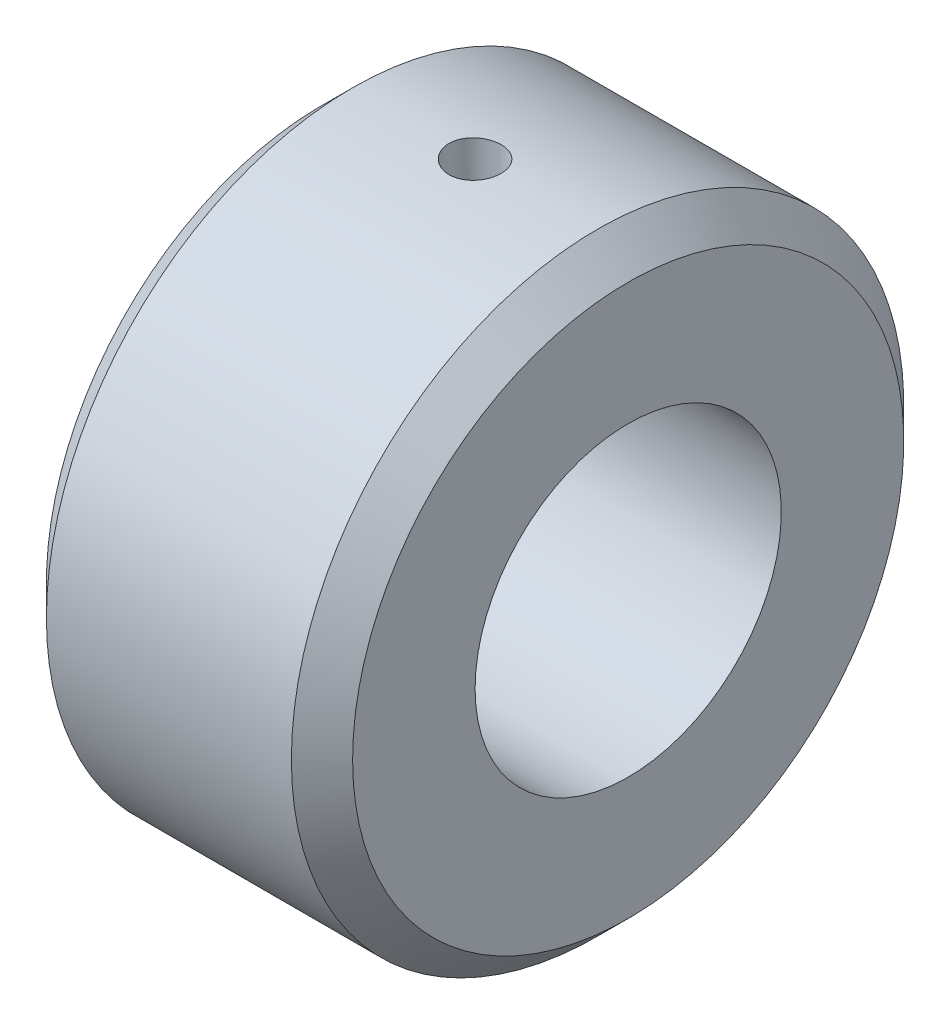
ISO-10303-21;
HEADER;
FILE_DESCRIPTION(('STEP AP214'),'2;1');
FILE_NAME('part.step','',(''),(''),'','','');
FILE_SCHEMA(('AUTOMOTIVE_DESIGN { 1 0 10303 214 1 1 1 1 }'));
ENDSEC;
DATA;
#1=APPLICATION_CONTEXT('core data for automotive mechanical design processes');
#2=APPLICATION_PROTOCOL_DEFINITION('international standard','automotive_design',2000,#1);
#3=PRODUCT_CONTEXT('',#1,'mechanical');
#4=PRODUCT('Part','Part','',(#3));
#5=PRODUCT_RELATED_PRODUCT_CATEGORY('part','',(#4));
#6=PRODUCT_DEFINITION_FORMATION('','',#4);
#7=PRODUCT_DEFINITION_CONTEXT('part definition',#1,'design');
#8=PRODUCT_DEFINITION('design','',#6,#7);
#9=PRODUCT_DEFINITION_SHAPE('','',#8);
#10=(LENGTH_UNIT() NAMED_UNIT(*) SI_UNIT(.MILLI.,.METRE.));
#11=(NAMED_UNIT(*) PLANE_ANGLE_UNIT() SI_UNIT($,.RADIAN.));
#12=(NAMED_UNIT(*) SI_UNIT($,.STERADIAN.) SOLID_ANGLE_UNIT());
#13=UNCERTAINTY_MEASURE_WITH_UNIT(LENGTH_MEASURE(1.E-05),#10,'distance_accuracy_value','');
#14=(GEOMETRIC_REPRESENTATION_CONTEXT(3) GLOBAL_UNCERTAINTY_ASSIGNED_CONTEXT((#13)) GLOBAL_UNIT_ASSIGNED_CONTEXT((#10,
#11,#12)) REPRESENTATION_CONTEXT('',''));
#15=CARTESIAN_POINT('',(0.,0.,0.));
#16=DIRECTION('',(0.,0.,1.));
#17=DIRECTION('',(1.,0.,0.));
#18=AXIS2_PLACEMENT_3D('',#15,#16,#17);
#19=CARTESIAN_POINT('',(-24.2284170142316,50.,0.));
#20=DIRECTION('',(1.,0.,0.));
#21=DIRECTION('',(0.,0.,-1.));
#22=AXIS2_PLACEMENT_3D('',#19,#20,#21);
#23=PLANE('',#22);
#24=CARTESIAN_POINT('',(-24.2284170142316,0.,0.));
#25=DIRECTION('',(1.,0.,0.));
#26=DIRECTION('',(0.,0.,-1.));
#27=AXIS2_PLACEMENT_3D('',#24,#25,#26);
#28=CIRCLE('',#27,45.);
#29=CARTESIAN_POINT('',(-24.2284170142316,0.,-45.));
#30=VERTEX_POINT('',#29);
#31=EDGE_CURVE('E42',#30,#30,#28,.F.);
#32=ORIENTED_EDGE('',*,*,#31,.T.);
#33=EDGE_LOOP('',(#32));
#34=FACE_BOUND('',#33,.T.);
#35=CARTESIAN_POINT('',(-24.2284170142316,0.,0.));
#36=DIRECTION('',(-1.,0.,0.));
#37=DIRECTION('',(0.,0.,1.));
#38=AXIS2_PLACEMENT_3D('',#35,#36,#37);
#39=CIRCLE('',#38,25.);
#40=CARTESIAN_POINT('',(-24.2284170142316,0.,25.));
#41=VERTEX_POINT('',#40);
#42=EDGE_CURVE('E58',#41,#41,#39,.T.);
#43=ORIENTED_EDGE('',*,*,#42,.F.);
#44=EDGE_LOOP('',(#43));
#45=FACE_BOUND('',#44,.T.);
#46=ADVANCED_FACE('F31',(#34,#45),#23,.F.);
#47=CARTESIAN_POINT('',(-35.4974481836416,0.,0.));
#48=DIRECTION('',(-1.,0.,0.));
#49=DIRECTION('',(0.,0.,1.));
#50=AXIS2_PLACEMENT_3D('',#47,#48,#49);
#51=CYLINDRICAL_SURFACE('',#50,25.);
#52=CARTESIAN_POINT('',(0.771582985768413,24.6361015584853,-4.24999999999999));
#53=CARTESIAN_POINT('',(0.53471664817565,24.6361058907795,-4.2499905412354));
#54=CARTESIAN_POINT('',(0.297722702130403,24.6395546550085,-4.23013092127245));
#55=CARTESIAN_POINT('',(-0.169610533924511,24.6529638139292,-4.15125457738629));
#56=CARTESIAN_POINT('',(-0.399943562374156,24.6629301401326,-4.09220218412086));
#57=CARTESIAN_POINT('',(-0.847124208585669,24.6882137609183,-3.93678254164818));
#58=CARTESIAN_POINT('',(-1.06398311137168,24.7035265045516,-3.84044702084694));
#59=CARTESIAN_POINT('',(-1.47843773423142,24.7377722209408,-3.61327556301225));
#60=CARTESIAN_POINT('',(-1.67603551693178,24.7567048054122,-3.48244332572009));
#61=CARTESIAN_POINT('',(-2.04840652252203,24.7962738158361,-3.18856188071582));
#62=CARTESIAN_POINT('',(-2.22295365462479,24.8169242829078,-3.02522804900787));
#63=CARTESIAN_POINT('',(-2.54230390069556,24.8574776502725,-2.67159497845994));
#64=CARTESIAN_POINT('',(-2.68710522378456,24.8773805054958,-2.48129411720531));
#65=CARTESIAN_POINT('',(-2.94370482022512,24.9143450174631,-2.07766083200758));
#66=CARTESIAN_POINT('',(-3.05529224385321,24.9313882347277,-1.86419253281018));
#67=CARTESIAN_POINT('',(-3.24094074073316,24.9605567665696,-1.42120303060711));
#68=CARTESIAN_POINT('',(-3.31500435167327,24.9726824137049,-1.19168291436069));
#69=CARTESIAN_POINT('',(-3.42281012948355,24.9905504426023,-0.725442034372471));
#70=CARTESIAN_POINT('',(-3.45693238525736,24.9963529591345,-0.488811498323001));
#71=CARTESIAN_POINT('',(-3.48506912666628,25.0011276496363,-0.013117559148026));
#72=CARTESIAN_POINT('',(-3.47908644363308,25.000100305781,0.225945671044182));
#73=CARTESIAN_POINT('',(-3.42747880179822,24.9913785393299,0.697118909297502));
#74=CARTESIAN_POINT('',(-3.38226292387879,24.9837529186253,0.929275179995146));
#75=CARTESIAN_POINT('',(-3.25411699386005,24.962768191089,1.38265670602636));
#76=CARTESIAN_POINT('',(-3.17118575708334,24.9494089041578,1.60388161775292));
#77=CARTESIAN_POINT('',(-2.96955924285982,24.9183410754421,2.03033266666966));
#78=CARTESIAN_POINT('',(-2.85069617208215,24.9006122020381,2.23547792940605));
#79=CARTESIAN_POINT('',(-2.58070311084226,24.8627735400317,2.62306501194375));
#80=CARTESIAN_POINT('',(-2.42957040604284,24.842663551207,2.80550491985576));
#81=CARTESIAN_POINT('',(-2.09706145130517,24.8019982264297,3.14492053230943));
#82=CARTESIAN_POINT('',(-1.91532760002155,24.7814404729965,3.30154582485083));
#83=CARTESIAN_POINT('',(-1.52797790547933,24.74244162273,3.58213794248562));
#84=CARTESIAN_POINT('',(-1.32236182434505,24.7240005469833,3.70610444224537));
#85=CARTESIAN_POINT('',(-0.89266912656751,24.6913214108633,3.91793359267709));
#86=CARTESIAN_POINT('',(-0.668570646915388,24.6770884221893,4.00575272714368));
#87=CARTESIAN_POINT('',(-0.208506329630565,24.6545198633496,4.14240191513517));
#88=CARTESIAN_POINT('',(0.0274584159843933,24.6461837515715,4.19123554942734));
#89=CARTESIAN_POINT('',(0.501418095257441,24.6364579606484,4.24803134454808));
#90=CARTESIAN_POINT('',(0.739351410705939,24.6349832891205,4.25649361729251));
#91=CARTESIAN_POINT('',(1.21323412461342,24.6389208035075,4.23364039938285));
#92=CARTESIAN_POINT('',(1.44918360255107,24.6443327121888,4.20232651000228));
#93=CARTESIAN_POINT('',(1.91080383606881,24.6613549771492,4.10123670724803));
#94=CARTESIAN_POINT('',(2.13653224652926,24.6729241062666,4.03171651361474));
#95=CARTESIAN_POINT('',(2.57313515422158,24.7009225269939,3.85645619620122));
#96=CARTESIAN_POINT('',(2.78400872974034,24.7173521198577,3.75071382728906));
#97=CARTESIAN_POINT('',(3.18713839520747,24.7534171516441,3.50483494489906));
#98=CARTESIAN_POINT('',(3.37919677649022,24.7730817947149,3.36437864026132));
#99=CARTESIAN_POINT('',(3.7371977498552,24.8133163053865,3.05349666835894));
#100=CARTESIAN_POINT('',(3.90313842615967,24.8338862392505,2.88306880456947));
#101=CARTESIAN_POINT('',(4.20602617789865,24.8738831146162,2.51486305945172));
#102=CARTESIAN_POINT('',(4.34263929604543,24.8932952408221,2.31680860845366));
#103=CARTESIAN_POINT('',(4.58065210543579,24.9285498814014,1.90026960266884));
#104=CARTESIAN_POINT('',(4.68205297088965,24.9443925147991,1.68178572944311));
#105=CARTESIAN_POINT('',(4.846246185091,24.9706588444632,1.23157131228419));
#106=CARTESIAN_POINT('',(4.90921164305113,24.9811068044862,0.999905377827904));
#107=CARTESIAN_POINT('',(4.99530340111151,24.9955093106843,0.529094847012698));
#108=CARTESIAN_POINT('',(5.01843311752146,24.9994644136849,0.289950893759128));
#109=CARTESIAN_POINT('',(5.02409536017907,25.0004272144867,-0.185807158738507));
#110=CARTESIAN_POINT('',(5.00713542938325,24.9975217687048,-0.422415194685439));
#111=CARTESIAN_POINT('',(4.93419970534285,24.9852677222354,-0.889360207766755));
#112=CARTESIAN_POINT('',(4.87822415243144,24.9759191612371,-1.11969722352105));
#113=CARTESIAN_POINT('',(4.72904388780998,24.9518260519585,-1.56735653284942));
#114=CARTESIAN_POINT('',(4.63588400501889,24.9370880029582,-1.78469413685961));
#115=CARTESIAN_POINT('',(4.41503667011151,24.9038227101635,-2.20073172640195));
#116=CARTESIAN_POINT('',(4.28734747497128,24.8852952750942,-2.39943077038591));
#117=CARTESIAN_POINT('',(3.99927474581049,24.8462259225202,-2.77510357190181));
#118=CARTESIAN_POINT('',(3.83852027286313,24.8256626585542,-2.95179069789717));
#119=CARTESIAN_POINT('',(3.48965757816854,24.7849850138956,-3.27586034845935));
#120=CARTESIAN_POINT('',(3.30154295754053,24.7648707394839,-3.42323599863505));
#121=CARTESIAN_POINT('',(2.90164588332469,24.7272075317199,-3.68550440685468));
#122=CARTESIAN_POINT('',(2.68969871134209,24.7096786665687,-3.8001489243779));
#123=CARTESIAN_POINT('',(2.24933989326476,24.6794086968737,-3.99202979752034));
#124=CARTESIAN_POINT('',(2.02094481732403,24.6666628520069,-4.06930321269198));
#125=CARTESIAN_POINT('',(1.62167337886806,24.650203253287,-4.16762904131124));
#126=CARTESIAN_POINT('',(1.45320323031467,24.6449448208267,-4.19846808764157));
#127=CARTESIAN_POINT('',(1.11370521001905,24.6378924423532,-4.2396567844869));
#128=CARTESIAN_POINT('',(0.942677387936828,24.6360984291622,-4.25000683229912));
#129=CARTESIAN_POINT('',(0.771582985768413,24.6361015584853,-4.24999999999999));
#130=B_SPLINE_CURVE_WITH_KNOTS('',3,(#52,#53,#54,#55,#56,#57,#58,#59,#60,#61,#62,#63,#64,#65,
#66,#67,#68,#69,#70,#71,#72,#73,#74,#75,#76,#77,#78,#79,#80,#81,#82,#83,#84,#85,#86,#87,#88,#89,
#90,#91,#92,#93,#94,#95,#96,#97,#98,#99,#100,#101,#102,#103,#104,#105,#106,#107,#108,#109,#110,
#111,#112,#113,#114,#115,#116,#117,#118,#119,#120,#121,#122,#123,#124,#125,#126,#127,#128,#129),
.UNSPECIFIED.,.T.,.F.,(4,2,2,2,2,2,2,2,2,2,2,2,2,2,2,2,2,2,2,2,2,2,2,2,2,2,2,2,2,2,2,2,2,2,2,2,
2,2,4),(0.,0.709973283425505,1.42059360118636,2.13061049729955,2.84055127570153,
3.55700687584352,4.27350559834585,4.99446029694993,5.71536623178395,6.42935464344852,
7.14329264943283,7.84987474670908,8.55647903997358,9.26643536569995,9.97645143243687,
10.6954278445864,11.4144114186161,12.1342580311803,12.8540385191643,13.5648789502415,
14.2756907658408,14.9818019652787,15.687956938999,16.4008768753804,17.1138490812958,
17.8345535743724,18.5552340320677,19.2726441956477,19.9899928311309,20.6983084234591,
21.4066196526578,22.1140795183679,22.8215751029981,23.5374888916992,24.2535703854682,
24.9749466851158,25.6956061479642,26.2084473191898,26.7212785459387),.UNSPECIFIED.);
#131=CARTESIAN_POINT('',(0.771582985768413,24.6361015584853,-4.24999999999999));
#132=VERTEX_POINT('',#131);
#133=EDGE_CURVE('E64',#132,#132,#130,.T.);
#134=ORIENTED_EDGE('',*,*,#133,.T.);
#135=EDGE_LOOP('',(#134));
#136=FACE_BOUND('',#135,.T.);
#137=CARTESIAN_POINT('',(25.7715829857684,0.,0.));
#138=DIRECTION('',(-1.,0.,0.));
#139=DIRECTION('',(0.,0.,1.));
#140=AXIS2_PLACEMENT_3D('',#137,#138,#139);
#141=CIRCLE('',#140,25.);
#142=CARTESIAN_POINT('',(25.7715829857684,0.,25.));
#143=VERTEX_POINT('',#142);
#144=EDGE_CURVE('E61',#143,#143,#141,.T.);
#145=ORIENTED_EDGE('',*,*,#144,.F.);
#146=EDGE_LOOP('',(#145));
#147=FACE_BOUND('',#146,.T.);
#148=ORIENTED_EDGE('',*,*,#42,.T.);
#149=EDGE_LOOP('',(#148));
#150=FACE_BOUND('',#149,.T.);
#151=ADVANCED_FACE('F69',(#136,#147,#150),#51,.F.);
#152=CARTESIAN_POINT('',(25.7715829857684,50.,0.));
#153=DIRECTION('',(-1.,0.,0.));
#154=DIRECTION('',(0.,0.,1.));
#155=AXIS2_PLACEMENT_3D('',#152,#153,#154);
#156=PLANE('',#155);
#157=CARTESIAN_POINT('',(25.7715829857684,0.,0.));
#158=DIRECTION('',(-1.,0.,0.));
#159=DIRECTION('',(0.,0.,1.));
#160=AXIS2_PLACEMENT_3D('',#157,#158,#159);
#161=CIRCLE('',#160,45.);
#162=CARTESIAN_POINT('',(25.7715829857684,0.,45.));
#163=VERTEX_POINT('',#162);
#164=EDGE_CURVE('E46',#163,#163,#161,.F.);
#165=ORIENTED_EDGE('',*,*,#164,.T.);
#166=EDGE_LOOP('',(#165));
#167=FACE_BOUND('',#166,.T.);
#168=ORIENTED_EDGE('',*,*,#144,.T.);
#169=EDGE_LOOP('',(#168));
#170=FACE_BOUND('',#169,.T.);
#171=ADVANCED_FACE('F82',(#167,#170),#156,.F.);
#172=CARTESIAN_POINT('',(-35.4974481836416,0.,0.));
#173=DIRECTION('',(-1.,0.,0.));
#174=DIRECTION('',(0.,0.,1.));
#175=AXIS2_PLACEMENT_3D('',#172,#173,#174);
#176=CYLINDRICAL_SURFACE('',#175,50.);
#177=CARTESIAN_POINT('',(-3.47841701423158,50.,0.));
#178=CARTESIAN_POINT('',(-3.47840661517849,49.9999976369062,-0.238263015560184));
#179=CARTESIAN_POINT('',(-3.45831340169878,49.9982787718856,-0.476687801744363));
#180=CARTESIAN_POINT('',(-3.37845414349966,49.9915871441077,-0.946939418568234));
#181=CARTESIAN_POINT('',(-3.31864326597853,49.9866107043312,-1.17875848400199));
#182=CARTESIAN_POINT('',(-3.16109183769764,49.973966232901,-1.62891998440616));
#183=CARTESIAN_POINT('',(-3.06337288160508,49.9662997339,-1.84727001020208));
#184=CARTESIAN_POINT('',(-2.8328181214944,49.949134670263,-2.26441672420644));
#185=CARTESIAN_POINT('',(-2.6999897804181,49.9396364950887,-2.46321755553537));
#186=CARTESIAN_POINT('',(-2.40260756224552,49.9198456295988,-2.8362003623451));
#187=CARTESIAN_POINT('',(-2.23797998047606,49.9095511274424,-3.01032348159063));
#188=CARTESIAN_POINT('',(-1.88182834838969,49.8893430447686,-3.3285030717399));
#189=CARTESIAN_POINT('',(-1.69030311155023,49.8794294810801,-3.47255821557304));
#190=CARTESIAN_POINT('',(-1.28543524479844,49.8610863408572,-3.72671284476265));
#191=CARTESIAN_POINT('',(-1.07205993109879,49.8526590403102,-3.83676044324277));
#192=CARTESIAN_POINT('',(-0.629776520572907,49.8382635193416,-4.01944470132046));
#193=CARTESIAN_POINT('',(-0.400868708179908,49.8322952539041,-4.09208204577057));
#194=CARTESIAN_POINT('',(0.0653910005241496,49.8235089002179,-4.19771278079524));
#195=CARTESIAN_POINT('',(0.302720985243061,49.82068317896,-4.23080224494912));
#196=CARTESIAN_POINT('',(0.779581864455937,49.81847777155,-4.2566947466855));
#197=CARTESIAN_POINT('',(1.0191127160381,49.8190980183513,-4.24949856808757));
#198=CARTESIAN_POINT('',(1.49291718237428,49.8237075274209,-4.19510343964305));
#199=CARTESIAN_POINT('',(1.72720288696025,49.8276879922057,-4.14800894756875));
#200=CARTESIAN_POINT('',(2.18453232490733,49.8385556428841,-4.01531634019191));
#201=CARTESIAN_POINT('',(2.40757594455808,49.845442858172,-3.92971783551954));
#202=CARTESIAN_POINT('',(2.83642243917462,49.8613581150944,-3.72233022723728));
#203=CARTESIAN_POINT('',(3.04220256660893,49.8703889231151,-3.60049430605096));
#204=CARTESIAN_POINT('',(3.43043195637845,49.8895712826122,-3.32412408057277));
#205=CARTESIAN_POINT('',(3.6128807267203,49.899722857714,-3.1695890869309));
#206=CARTESIAN_POINT('',(3.94987568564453,49.9200420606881,-2.83162174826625));
#207=CARTESIAN_POINT('',(4.10433133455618,49.9302096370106,-2.64809910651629));
#208=CARTESIAN_POINT('',(4.38025542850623,49.9493844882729,-2.25768089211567));
#209=CARTESIAN_POINT('',(4.50172385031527,49.9583917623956,-2.0507853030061));
#210=CARTESIAN_POINT('',(4.70821999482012,49.9742329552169,-1.61943499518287));
#211=CARTESIAN_POINT('',(4.79324365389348,49.9810666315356,-1.39497832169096));
#212=CARTESIAN_POINT('',(4.92437310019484,49.9917879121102,-0.934904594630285));
#213=CARTESIAN_POINT('',(4.97047972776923,49.9956755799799,-0.699287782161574));
#214=CARTESIAN_POINT('',(5.02235267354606,50.0000586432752,-0.224366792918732));
#215=CARTESIAN_POINT('',(5.02824403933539,50.0005645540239,0.0149236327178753));
#216=CARTESIAN_POINT('',(4.99984688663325,49.9981551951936,0.491088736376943));
#217=CARTESIAN_POINT('',(4.96555875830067,49.9952399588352,0.727963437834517));
#218=CARTESIAN_POINT('',(4.85787958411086,49.986322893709,1.19221613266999));
#219=CARTESIAN_POINT('',(4.78454655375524,49.9803256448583,1.41960767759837));
#220=CARTESIAN_POINT('',(4.60091852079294,49.9659181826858,1.8588591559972));
#221=CARTESIAN_POINT('',(4.49062291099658,49.9575079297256,2.07071883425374));
#222=CARTESIAN_POINT('',(4.23588674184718,49.9391908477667,2.47346138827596));
#223=CARTESIAN_POINT('',(4.09136340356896,49.929280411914,2.66429173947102));
#224=CARTESIAN_POINT('',(3.77239376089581,49.9090883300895,3.01902832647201));
#225=CARTESIAN_POINT('',(3.59794691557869,49.8988066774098,3.18293407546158));
#226=CARTESIAN_POINT('',(3.22353926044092,49.8789997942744,3.47959819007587));
#227=CARTESIAN_POINT('',(3.02351363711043,49.8694765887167,3.61227491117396));
#228=CARTESIAN_POINT('',(2.60394876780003,49.8522937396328,3.84215482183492));
#229=CARTESIAN_POINT('',(2.38440972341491,49.8446340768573,3.93935837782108));
#230=CARTESIAN_POINT('',(1.93233817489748,49.8320570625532,4.09539385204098));
#231=CARTESIAN_POINT('',(1.69982298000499,49.8271361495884,4.15427562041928));
#232=CARTESIAN_POINT('',(1.22816266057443,49.8205819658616,4.23215833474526));
#233=CARTESIAN_POINT('',(0.989017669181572,49.8189486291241,4.25116008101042));
#234=CARTESIAN_POINT('',(0.511697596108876,49.8191555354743,4.24873394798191));
#235=CARTESIAN_POINT('',(0.273521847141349,49.8209847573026,4.22743434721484));
#236=CARTESIAN_POINT('',(-0.195856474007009,49.827887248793,4.14527775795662));
#237=CARTESIAN_POINT('',(-0.427059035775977,49.8329605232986,4.08442071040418));
#238=CARTESIAN_POINT('',(-0.875935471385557,49.8457765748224,3.92490950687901));
#239=CARTESIAN_POINT('',(-1.09361022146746,49.8535191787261,3.82625780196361));
#240=CARTESIAN_POINT('',(-1.50932936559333,49.8708017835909,3.59397189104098));
#241=CARTESIAN_POINT('',(-1.70737404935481,49.8803417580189,3.46033820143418));
#242=CARTESIAN_POINT('',(-2.07886792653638,49.9001803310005,3.16139959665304));
#243=CARTESIAN_POINT('',(-2.25224050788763,49.9104811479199,2.99599962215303));
#244=CARTESIAN_POINT('',(-2.56883457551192,49.9306604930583,2.63839793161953));
#245=CARTESIAN_POINT('',(-2.71204876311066,49.9405389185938,2.44618974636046));
#246=CARTESIAN_POINT('',(-2.96446087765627,49.9587789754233,2.04004301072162));
#247=CARTESIAN_POINT('',(-3.07359294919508,49.967137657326,1.82606343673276));
#248=CARTESIAN_POINT('',(-3.25423899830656,49.9813621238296,1.38289152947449));
#249=CARTESIAN_POINT('',(-3.32579614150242,49.9872307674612,1.15371699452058));
#250=CARTESIAN_POINT('',(-3.41107188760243,49.9943102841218,0.769329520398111));
#251=CARTESIAN_POINT('',(-3.43629265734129,49.9964341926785,0.616587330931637));
#252=CARTESIAN_POINT('',(-3.46996857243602,49.9992798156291,0.309252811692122));
#253=CARTESIAN_POINT('',(-3.47842376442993,50.0000015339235,0.154660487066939));
#254=CARTESIAN_POINT('',(-3.47841701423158,50.,0.));
#255=B_SPLINE_CURVE_WITH_KNOTS('',3,(#177,#178,#179,#180,#181,#182,#183,#184,#185,#186,#187,
#188,#189,#190,#191,#192,#193,#194,#195,#196,#197,#198,#199,#200,#201,#202,#203,#204,#205,#206,
#207,#208,#209,#210,#211,#212,#213,#214,#215,#216,#217,#218,#219,#220,#221,#222,#223,#224,#225,
#226,#227,#228,#229,#230,#231,#232,#233,#234,#235,#236,#237,#238,#239,#240,#241,#242,#243,#244,
#245,#246,#247,#248,#249,#250,#251,#252,#253,#254),.UNSPECIFIED.,.T.,.F.,(4,2,2,2,2,2,2,2,2,2,2,
2,2,2,2,2,2,2,2,2,2,2,2,2,2,2,2,2,2,2,2,2,2,2,2,2,2,2,4),(0.,0.714224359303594,1.42925629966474,
2.14388151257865,2.85835494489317,3.57450470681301,4.29068606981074,5.00795480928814,
5.7252104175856,6.44072003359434,7.15621572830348,7.86984395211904,8.5834793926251,
9.2980408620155,10.0126173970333,10.7294654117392,11.446313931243,12.1632423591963,
12.8801553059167,13.5948380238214,14.3095138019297,15.0231306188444,15.7367591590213,
16.4521315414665,17.1675168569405,17.884752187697,18.6019801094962,19.3182731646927,
20.0345518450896,20.7485544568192,21.4625581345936,22.1765155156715,22.8904623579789,
23.6065799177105,24.3228705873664,25.0405368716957,25.7573768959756,26.2209930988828,
26.6846080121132),.UNSPECIFIED.);
#256=CARTESIAN_POINT('',(-3.47841701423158,50.,0.));
#257=VERTEX_POINT('',#256);
#258=EDGE_CURVE('E10',#257,#257,#255,.T.);
#259=ORIENTED_EDGE('',*,*,#258,.T.);
#260=EDGE_LOOP('',(#259));
#261=FACE_BOUND('',#260,.T.);
#262=CARTESIAN_POINT('',(20.7715829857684,0.,0.));
#263=DIRECTION('',(-1.,0.,0.));
#264=DIRECTION('',(0.,0.,1.));
#265=AXIS2_PLACEMENT_3D('',#262,#263,#264);
#266=CIRCLE('',#265,50.);
#267=CARTESIAN_POINT('',(20.7715829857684,0.,50.));
#268=VERTEX_POINT('',#267);
#269=EDGE_CURVE('E50',#268,#268,#266,.T.);
#270=ORIENTED_EDGE('',*,*,#269,.T.);
#271=EDGE_LOOP('',(#270));
#272=FACE_BOUND('',#271,.T.);
#273=CARTESIAN_POINT('',(-19.2284170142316,0.,0.));
#274=DIRECTION('',(1.,0.,0.));
#275=DIRECTION('',(0.,0.,-1.));
#276=AXIS2_PLACEMENT_3D('',#273,#274,#275);
#277=CIRCLE('',#276,50.);
#278=CARTESIAN_POINT('',(-19.2284170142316,0.,-50.));
#279=VERTEX_POINT('',#278);
#280=EDGE_CURVE('E55',#279,#279,#277,.T.);
#281=ORIENTED_EDGE('',*,*,#280,.T.);
#282=EDGE_LOOP('',(#281));
#283=FACE_BOUND('',#282,.T.);
#284=ADVANCED_FACE('F77',(#261,#272,#283),#176,.T.);
#285=CARTESIAN_POINT('',(20.7715829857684,0.,0.));
#286=DIRECTION('',(-1.,0.,0.));
#287=DIRECTION('',(0.,0.,1.));
#288=AXIS2_PLACEMENT_3D('',#285,#286,#287);
#289=CONICAL_SURFACE('',#288,50.,0.78539816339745);
#290=ORIENTED_EDGE('',*,*,#164,.F.);
#291=EDGE_LOOP('',(#290));
#292=FACE_BOUND('',#291,.T.);
#293=ORIENTED_EDGE('',*,*,#269,.F.);
#294=EDGE_LOOP('',(#293));
#295=FACE_BOUND('',#294,.T.);
#296=ADVANCED_FACE('F81',(#292,#295),#289,.T.);
#297=CARTESIAN_POINT('',(-24.2284170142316,0.,0.));
#298=DIRECTION('',(1.,0.,0.));
#299=DIRECTION('',(0.,0.,-1.));
#300=AXIS2_PLACEMENT_3D('',#297,#298,#299);
#301=CONICAL_SURFACE('',#300,45.,0.785398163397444);
#302=ORIENTED_EDGE('',*,*,#280,.F.);
#303=EDGE_LOOP('',(#302));
#304=FACE_BOUND('',#303,.T.);
#305=ORIENTED_EDGE('',*,*,#31,.F.);
#306=EDGE_LOOP('',(#305));
#307=FACE_BOUND('',#306,.T.);
#308=ADVANCED_FACE('F33',(#304,#307),#301,.T.);
#309=CARTESIAN_POINT('',(0.771582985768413,0.,0.));
#310=DIRECTION('',(0.,-1.,0.));
#311=DIRECTION('',(0.,0.,-1.));
#312=AXIS2_PLACEMENT_3D('',#309,#310,#311);
#313=CYLINDRICAL_SURFACE('',#312,4.24999999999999);
#314=ORIENTED_EDGE('',*,*,#258,.F.);
#315=EDGE_LOOP('',(#314));
#316=FACE_BOUND('',#315,.T.);
#317=ORIENTED_EDGE('',*,*,#133,.F.);
#318=EDGE_LOOP('',(#317));
#319=FACE_BOUND('',#318,.T.);
#320=ADVANCED_FACE('F73',(#316,#319),#313,.F.);
#321=CLOSED_SHELL('',(#46,#151,#171,#284,#296,#308,#320));
#322=MANIFOLD_SOLID_BREP('B2',#321);
#323=ADVANCED_BREP_SHAPE_REPRESENTATION('',(#18,#322),#14);
#324=SHAPE_DEFINITION_REPRESENTATION(#9,#323);
ENDSEC;
END-ISO-10303-21;
